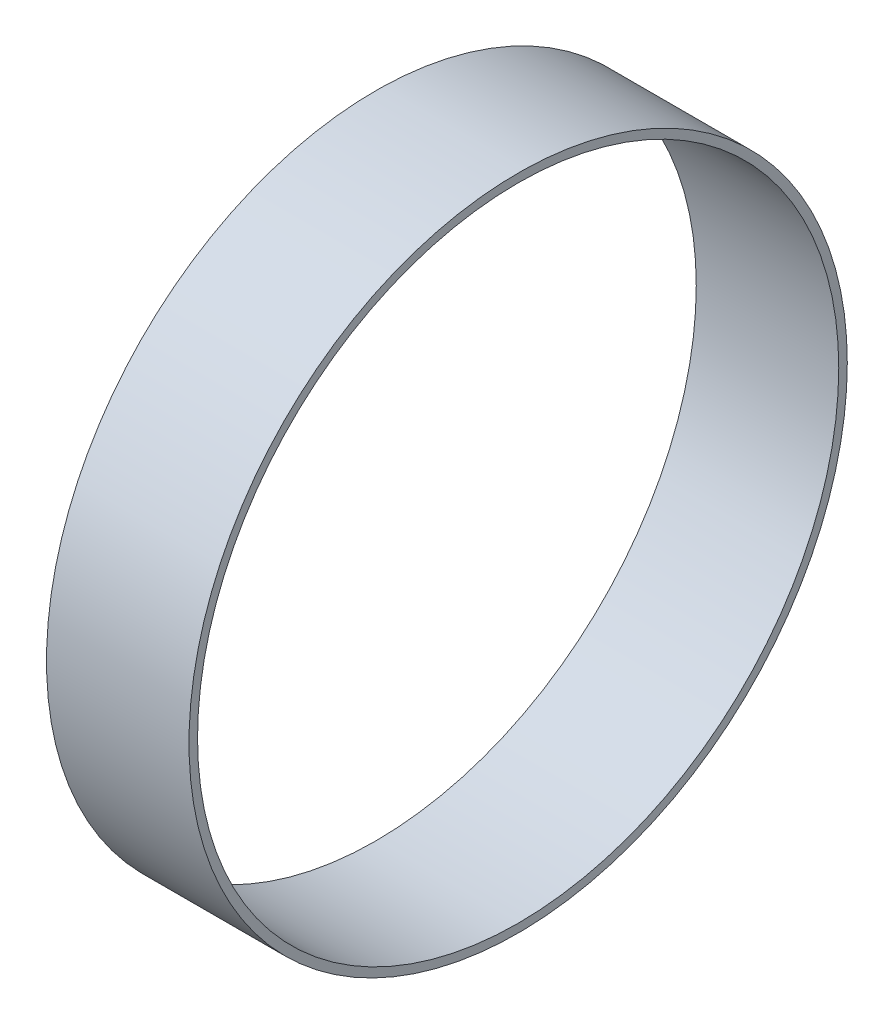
ISO-10303-21;
HEADER;
FILE_DESCRIPTION(('STEP AP214'),'2;1');
FILE_NAME('part.step','',(''),(''),'','','');
FILE_SCHEMA(('AUTOMOTIVE_DESIGN { 1 0 10303 214 1 1 1 1 }'));
ENDSEC;
DATA;
#1=APPLICATION_CONTEXT('core data for automotive mechanical design processes');
#2=APPLICATION_PROTOCOL_DEFINITION('international standard','automotive_design',2000,#1);
#3=PRODUCT_CONTEXT('',#1,'mechanical');
#4=PRODUCT('Part','Part','',(#3));
#5=PRODUCT_RELATED_PRODUCT_CATEGORY('part','',(#4));
#6=PRODUCT_DEFINITION_FORMATION('','',#4);
#7=PRODUCT_DEFINITION_CONTEXT('part definition',#1,'design');
#8=PRODUCT_DEFINITION('design','',#6,#7);
#9=PRODUCT_DEFINITION_SHAPE('','',#8);
#10=(LENGTH_UNIT() NAMED_UNIT(*) SI_UNIT(.MILLI.,.METRE.));
#11=(NAMED_UNIT(*) PLANE_ANGLE_UNIT() SI_UNIT($,.RADIAN.));
#12=(NAMED_UNIT(*) SI_UNIT($,.STERADIAN.) SOLID_ANGLE_UNIT());
#13=UNCERTAINTY_MEASURE_WITH_UNIT(LENGTH_MEASURE(1.E-05),#10,'distance_accuracy_value','');
#14=(GEOMETRIC_REPRESENTATION_CONTEXT(3) GLOBAL_UNCERTAINTY_ASSIGNED_CONTEXT((#13)) GLOBAL_UNIT_ASSIGNED_CONTEXT((#10,
#11,#12)) REPRESENTATION_CONTEXT('',''));
#15=CARTESIAN_POINT('',(0.,0.,0.));
#16=DIRECTION('',(0.,0.,1.));
#17=DIRECTION('',(1.,0.,0.));
#18=AXIS2_PLACEMENT_3D('',#15,#16,#17);
#19=CARTESIAN_POINT('',(10.,0.,0.));
#20=DIRECTION('',(1.,0.,0.));
#21=DIRECTION('',(0.,0.,-1.));
#22=AXIS2_PLACEMENT_3D('',#19,#20,#21);
#23=PLANE('',#22);
#24=CARTESIAN_POINT('',(10.,0.,0.));
#25=DIRECTION('',(1.,0.,0.));
#26=DIRECTION('',(0.,0.,-1.));
#27=AXIS2_PLACEMENT_3D('',#24,#25,#26);
#28=CIRCLE('',#27,23.1);
#29=CARTESIAN_POINT('',(10.,0.,-23.1));
#30=VERTEX_POINT('',#29);
#31=EDGE_CURVE('E10',#30,#30,#28,.T.);
#32=ORIENTED_EDGE('',*,*,#31,.T.);
#33=EDGE_LOOP('',(#32));
#34=FACE_BOUND('',#33,.T.);
#35=CARTESIAN_POINT('',(10.,0.,0.));
#36=DIRECTION('',(1.,0.,0.));
#37=DIRECTION('',(0.,0.,-1.));
#38=AXIS2_PLACEMENT_3D('',#35,#36,#37);
#39=CIRCLE('',#38,22.5);
#40=CARTESIAN_POINT('',(10.,0.,-22.5));
#41=VERTEX_POINT('',#40);
#42=EDGE_CURVE('E44',#41,#41,#39,.T.);
#43=ORIENTED_EDGE('',*,*,#42,.F.);
#44=EDGE_LOOP('',(#43));
#45=FACE_BOUND('',#44,.T.);
#46=ADVANCED_FACE('F33',(#34,#45),#23,.T.);
#47=CARTESIAN_POINT('',(0.,0.,0.));
#48=DIRECTION('',(1.,0.,0.));
#49=DIRECTION('',(0.,0.,-1.));
#50=AXIS2_PLACEMENT_3D('',#47,#48,#49);
#51=PLANE('',#50);
#52=CARTESIAN_POINT('',(0.,0.,0.));
#53=DIRECTION('',(1.,0.,0.));
#54=DIRECTION('',(0.,0.,-1.));
#55=AXIS2_PLACEMENT_3D('',#52,#53,#54);
#56=CIRCLE('',#55,23.1);
#57=CARTESIAN_POINT('',(0.,0.,-23.1));
#58=VERTEX_POINT('',#57);
#59=EDGE_CURVE('E37',#58,#58,#56,.T.);
#60=ORIENTED_EDGE('',*,*,#59,.F.);
#61=EDGE_LOOP('',(#60));
#62=FACE_BOUND('',#61,.T.);
#63=CARTESIAN_POINT('',(0.,0.,0.));
#64=DIRECTION('',(1.,0.,0.));
#65=DIRECTION('',(0.,0.,-1.));
#66=AXIS2_PLACEMENT_3D('',#63,#64,#65);
#67=CIRCLE('',#66,22.5);
#68=CARTESIAN_POINT('',(0.,0.,-22.5));
#69=VERTEX_POINT('',#68);
#70=EDGE_CURVE('E46',#69,#69,#67,.T.);
#71=ORIENTED_EDGE('',*,*,#70,.T.);
#72=EDGE_LOOP('',(#71));
#73=FACE_BOUND('',#72,.T.);
#74=ADVANCED_FACE('F56',(#62,#73),#51,.F.);
#75=CARTESIAN_POINT('',(10.,0.,0.));
#76=DIRECTION('',(-1.,0.,0.));
#77=DIRECTION('',(0.,0.,1.));
#78=AXIS2_PLACEMENT_3D('',#75,#76,#77);
#79=CYLINDRICAL_SURFACE('',#78,23.1);
#80=ORIENTED_EDGE('',*,*,#31,.F.);
#81=EDGE_LOOP('',(#80));
#82=FACE_BOUND('',#81,.T.);
#83=ORIENTED_EDGE('',*,*,#59,.T.);
#84=EDGE_LOOP('',(#83));
#85=FACE_BOUND('',#84,.T.);
#86=ADVANCED_FACE('F35',(#82,#85),#79,.T.);
#87=CARTESIAN_POINT('',(10.,0.,0.));
#88=DIRECTION('',(-1.,0.,0.));
#89=DIRECTION('',(0.,0.,1.));
#90=AXIS2_PLACEMENT_3D('',#87,#88,#89);
#91=CYLINDRICAL_SURFACE('',#90,22.5);
#92=ORIENTED_EDGE('',*,*,#42,.T.);
#93=EDGE_LOOP('',(#92));
#94=FACE_BOUND('',#93,.T.);
#95=ORIENTED_EDGE('',*,*,#70,.F.);
#96=EDGE_LOOP('',(#95));
#97=FACE_BOUND('',#96,.T.);
#98=ADVANCED_FACE('F52',(#94,#97),#91,.F.);
#99=CLOSED_SHELL('',(#46,#74,#86,#98));
#100=MANIFOLD_SOLID_BREP('B2',#99);
#101=ADVANCED_BREP_SHAPE_REPRESENTATION('',(#18,#100),#14);
#102=SHAPE_DEFINITION_REPRESENTATION(#9,#101);
ENDSEC;
END-ISO-10303-21;
